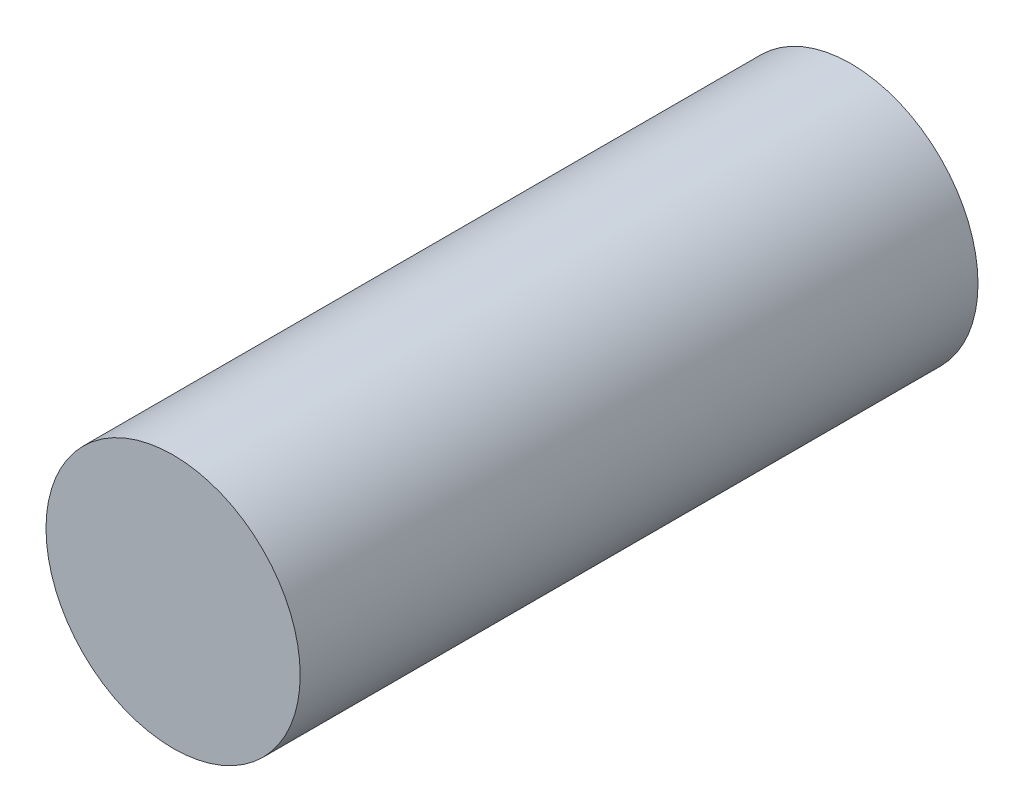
from build123d import *

# Parameters (mm, degrees)
ESQUISSE1_R        = 1.5
BOSS_EXTRU_1_DEPTH = 8


with BuildPart() as part:
    # Esquisse1 → Boss.-Extru.1 (new body)
    with BuildSketch(Plane.XY):
        Circle(ESQUISSE1_R)
    extrude(amount=BOSS_EXTRU_1_DEPTH)


solid = part.part
